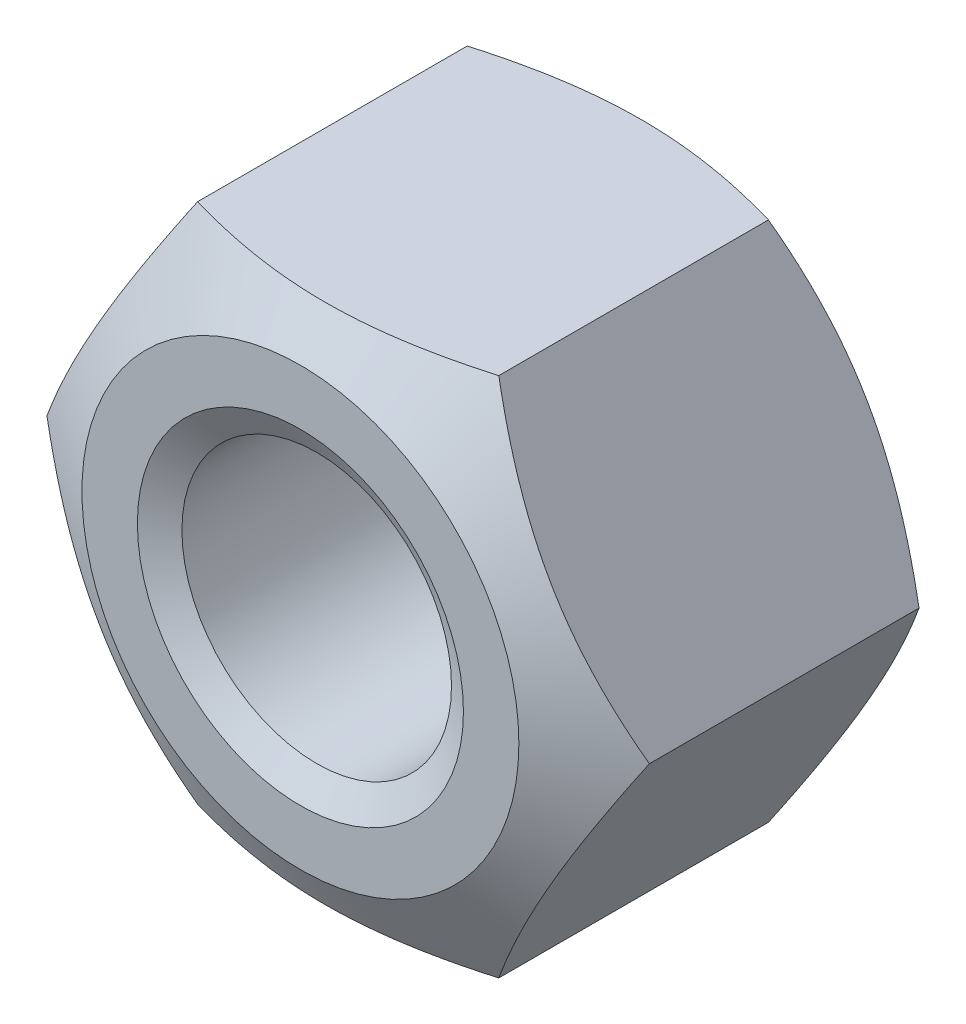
ISO-10303-21;
HEADER;
FILE_DESCRIPTION(('STEP AP214'),'2;1');
FILE_NAME('part.step','',(''),(''),'','','');
FILE_SCHEMA(('AUTOMOTIVE_DESIGN { 1 0 10303 214 1 1 1 1 }'));
ENDSEC;
DATA;
#1=APPLICATION_CONTEXT('core data for automotive mechanical design processes');
#2=APPLICATION_PROTOCOL_DEFINITION('international standard','automotive_design',2000,#1);
#3=PRODUCT_CONTEXT('',#1,'mechanical');
#4=PRODUCT('Part','Part','',(#3));
#5=PRODUCT_RELATED_PRODUCT_CATEGORY('part','',(#4));
#6=PRODUCT_DEFINITION_FORMATION('','',#4);
#7=PRODUCT_DEFINITION_CONTEXT('part definition',#1,'design');
#8=PRODUCT_DEFINITION('design','',#6,#7);
#9=PRODUCT_DEFINITION_SHAPE('','',#8);
#10=(LENGTH_UNIT() NAMED_UNIT(*) SI_UNIT(.MILLI.,.METRE.));
#11=(NAMED_UNIT(*) PLANE_ANGLE_UNIT() SI_UNIT($,.RADIAN.));
#12=(NAMED_UNIT(*) SI_UNIT($,.STERADIAN.) SOLID_ANGLE_UNIT());
#13=UNCERTAINTY_MEASURE_WITH_UNIT(LENGTH_MEASURE(1.E-05),#10,'distance_accuracy_value','');
#14=(GEOMETRIC_REPRESENTATION_CONTEXT(3) GLOBAL_UNCERTAINTY_ASSIGNED_CONTEXT((#13)) GLOBAL_UNIT_ASSIGNED_CONTEXT((#10,
#11,#12)) REPRESENTATION_CONTEXT('',''));
#15=CARTESIAN_POINT('',(0.,0.,0.));
#16=DIRECTION('',(0.,0.,1.));
#17=DIRECTION('',(1.,0.,0.));
#18=AXIS2_PLACEMENT_3D('',#15,#16,#17);
#19=CARTESIAN_POINT('',(0.,0.,0.124996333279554));
#20=DIRECTION('',(0.,0.,-1.));
#21=DIRECTION('',(1.,0.,0.));
#22=AXIS2_PLACEMENT_3D('',#19,#20,#21);
#23=CONICAL_SURFACE('',#22,2.2835,1.0471975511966);
#24=CARTESIAN_POINT('',(0.,0.,0.249992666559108));
#25=DIRECTION('',(0.,0.,1.));
#26=DIRECTION('',(1.,0.,0.));
#27=AXIS2_PLACEMENT_3D('',#24,#25,#26);
#28=CIRCLE('',#27,2.067);
#29=CARTESIAN_POINT('',(2.067,0.,0.249992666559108));
#30=VERTEX_POINT('',#29);
#31=EDGE_CURVE('E11',#30,#30,#28,.T.);
#32=ORIENTED_EDGE('',*,*,#31,.T.);
#33=EDGE_LOOP('',(#32));
#34=FACE_BOUND('',#33,.T.);
#35=CARTESIAN_POINT('',(0.,0.,0.));
#36=DIRECTION('',(0.,0.,1.));
#37=DIRECTION('',(1.,0.,0.));
#38=AXIS2_PLACEMENT_3D('',#35,#36,#37);
#39=CIRCLE('',#38,2.5);
#40=CARTESIAN_POINT('',(2.5,0.,0.));
#41=VERTEX_POINT('',#40);
#42=EDGE_CURVE('E137',#41,#41,#39,.T.);
#43=ORIENTED_EDGE('',*,*,#42,.F.);
#44=EDGE_LOOP('',(#43));
#45=FACE_BOUND('',#44,.T.);
#46=ADVANCED_FACE('F17',(#34,#45),#23,.F.);
#47=CARTESIAN_POINT('',(0.,0.,2.8));
#48=DIRECTION('',(0.,0.,-1.));
#49=DIRECTION('',(1.,0.,0.));
#50=AXIS2_PLACEMENT_3D('',#47,#48,#49);
#51=CYLINDRICAL_SURFACE('',#50,2.067);
#52=CARTESIAN_POINT('',(0.,0.,5.35000733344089));
#53=DIRECTION('',(0.,0.,1.));
#54=DIRECTION('',(1.,0.,0.));
#55=AXIS2_PLACEMENT_3D('',#52,#53,#54);
#56=CIRCLE('',#55,2.067);
#57=CARTESIAN_POINT('',(2.067,0.,5.35000733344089));
#58=VERTEX_POINT('',#57);
#59=EDGE_CURVE('E29',#58,#58,#56,.T.);
#60=ORIENTED_EDGE('',*,*,#59,.T.);
#61=EDGE_LOOP('',(#60));
#62=FACE_BOUND('',#61,.T.);
#63=ORIENTED_EDGE('',*,*,#31,.F.);
#64=EDGE_LOOP('',(#63));
#65=FACE_BOUND('',#64,.T.);
#66=ADVANCED_FACE('F244',(#62,#65),#51,.F.);
#67=CARTESIAN_POINT('',(0.,0.,5.47500366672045));
#68=DIRECTION('',(0.,0.,1.));
#69=DIRECTION('',(1.,0.,0.));
#70=AXIS2_PLACEMENT_3D('',#67,#68,#69);
#71=CONICAL_SURFACE('',#70,2.2835,1.0471975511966);
#72=CARTESIAN_POINT('',(0.,0.,5.6));
#73=DIRECTION('',(0.,0.,-1.));
#74=DIRECTION('',(1.,0.,0.));
#75=AXIS2_PLACEMENT_3D('',#72,#73,#74);
#76=CIRCLE('',#75,2.5);
#77=CARTESIAN_POINT('',(2.5,0.,5.6));
#78=VERTEX_POINT('',#77);
#79=EDGE_CURVE('E98',#78,#78,#76,.T.);
#80=ORIENTED_EDGE('',*,*,#79,.F.);
#81=EDGE_LOOP('',(#80));
#82=FACE_BOUND('',#81,.T.);
#83=ORIENTED_EDGE('',*,*,#59,.F.);
#84=EDGE_LOOP('',(#83));
#85=FACE_BOUND('',#84,.T.);
#86=ADVANCED_FACE('F249',(#82,#85),#71,.F.);
#87=CARTESIAN_POINT('',(0.,0.,0.36627163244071));
#88=DIRECTION('',(0.,0.,1.));
#89=DIRECTION('',(1.,0.,0.));
#90=AXIS2_PLACEMENT_3D('',#87,#88,#89);
#91=CONICAL_SURFACE('',#90,3.98440107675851,1.0471975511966);
#92=CARTESIAN_POINT('',(4.61880215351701,0.,0.73254326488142));
#93=CARTESIAN_POINT('',(3.46410161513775,-2.,0.0658765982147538));
#94=CARTESIAN_POINT('',(2.3094010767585,-4.,0.73254326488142));
#95=(BOUNDED_CURVE() B_SPLINE_CURVE(2,(#92,#93,#94),.UNSPECIFIED.,.F.,
.F.) B_SPLINE_CURVE_WITH_KNOTS((3,3),(0.,4.67374455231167),
.UNSPECIFIED.) CURVE() GEOMETRIC_REPRESENTATION_ITEM() RATIONAL_B_SPLINE_CURVE((1.,
1.15470053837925,1.)) REPRESENTATION_ITEM(''));
#96=CARTESIAN_POINT('',(4.61880215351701,0.,0.73254326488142));
#97=VERTEX_POINT('',#96);
#98=CARTESIAN_POINT('',(2.3094010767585,-4.,0.73254326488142));
#99=VERTEX_POINT('',#98);
#100=EDGE_CURVE('E86',#97,#99,#95,.T.);
#101=ORIENTED_EDGE('',*,*,#100,.T.);
#102=CARTESIAN_POINT('',(2.30940107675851,-4.,0.73254326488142));
#103=CARTESIAN_POINT('',(0.,-4.,0.0658765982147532));
#104=CARTESIAN_POINT('',(-2.30940107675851,-4.,0.73254326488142));
#105=(BOUNDED_CURVE() B_SPLINE_CURVE(2,(#102,#103,#104),.UNSPECIFIED.,.F.,
.F.) B_SPLINE_CURVE_WITH_KNOTS((3,3),(0.,4.67374455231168),
.UNSPECIFIED.) CURVE() GEOMETRIC_REPRESENTATION_ITEM() RATIONAL_B_SPLINE_CURVE((1.,
1.15470053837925,1.)) REPRESENTATION_ITEM(''));
#106=CARTESIAN_POINT('',(-2.30940107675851,-4.,0.73254326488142));
#107=VERTEX_POINT('',#106);
#108=EDGE_CURVE('E79',#99,#107,#105,.T.);
#109=ORIENTED_EDGE('',*,*,#108,.T.);
#110=CARTESIAN_POINT('',(-2.30940107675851,-4.,0.73254326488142));
#111=CARTESIAN_POINT('',(-3.46410161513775,-2.,0.0658765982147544));
#112=CARTESIAN_POINT('',(-4.61880215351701,0.,0.73254326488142));
#113=(BOUNDED_CURVE() B_SPLINE_CURVE(2,(#110,#111,#112),.UNSPECIFIED.,.F.,
.F.) B_SPLINE_CURVE_WITH_KNOTS((3,3),(0.,4.67374455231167),
.UNSPECIFIED.) CURVE() GEOMETRIC_REPRESENTATION_ITEM() RATIONAL_B_SPLINE_CURVE((1.,
1.15470053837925,1.)) REPRESENTATION_ITEM(''));
#114=CARTESIAN_POINT('',(-4.61880215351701,0.,0.73254326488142));
#115=VERTEX_POINT('',#114);
#116=EDGE_CURVE('E70',#107,#115,#113,.T.);
#117=ORIENTED_EDGE('',*,*,#116,.T.);
#118=CARTESIAN_POINT('',(-4.61880215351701,0.,0.73254326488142));
#119=CARTESIAN_POINT('',(-3.46410161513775,2.,0.0658765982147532));
#120=CARTESIAN_POINT('',(-2.3094010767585,4.,0.73254326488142));
#121=(BOUNDED_CURVE() B_SPLINE_CURVE(2,(#118,#119,#120),.UNSPECIFIED.,.F.,
.F.) B_SPLINE_CURVE_WITH_KNOTS((3,3),(0.,4.67374455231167),
.UNSPECIFIED.) CURVE() GEOMETRIC_REPRESENTATION_ITEM() RATIONAL_B_SPLINE_CURVE((1.,
1.15470053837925,1.)) REPRESENTATION_ITEM(''));
#122=CARTESIAN_POINT('',(-2.3094010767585,4.,0.73254326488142));
#123=VERTEX_POINT('',#122);
#124=EDGE_CURVE('E21',#115,#123,#121,.T.);
#125=ORIENTED_EDGE('',*,*,#124,.T.);
#126=CARTESIAN_POINT('',(-2.30940107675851,4.,0.73254326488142));
#127=CARTESIAN_POINT('',(0.,4.,0.0658765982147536));
#128=CARTESIAN_POINT('',(2.30940107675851,4.,0.73254326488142));
#129=(BOUNDED_CURVE() B_SPLINE_CURVE(2,(#126,#127,#128),.UNSPECIFIED.,.F.,
.F.) B_SPLINE_CURVE_WITH_KNOTS((3,3),(0.,4.67374455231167),
.UNSPECIFIED.) CURVE() GEOMETRIC_REPRESENTATION_ITEM() RATIONAL_B_SPLINE_CURVE((1.,
1.15470053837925,1.)) REPRESENTATION_ITEM(''));
#130=CARTESIAN_POINT('',(2.30940107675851,4.,0.73254326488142));
#131=VERTEX_POINT('',#130);
#132=EDGE_CURVE('E177',#123,#131,#129,.T.);
#133=ORIENTED_EDGE('',*,*,#132,.T.);
#134=CARTESIAN_POINT('',(2.30940107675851,4.,0.73254326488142));
#135=CARTESIAN_POINT('',(3.46410161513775,2.,0.065876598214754));
#136=CARTESIAN_POINT('',(4.61880215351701,0.,0.73254326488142));
#137=(BOUNDED_CURVE() B_SPLINE_CURVE(2,(#134,#135,#136),.UNSPECIFIED.,.F.,
.F.) B_SPLINE_CURVE_WITH_KNOTS((3,3),(0.,4.67374455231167),
.UNSPECIFIED.) CURVE() GEOMETRIC_REPRESENTATION_ITEM() RATIONAL_B_SPLINE_CURVE((1.,
1.15470053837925,1.)) REPRESENTATION_ITEM(''));
#138=EDGE_CURVE('E119',#131,#97,#137,.T.);
#139=ORIENTED_EDGE('',*,*,#138,.T.);
#140=EDGE_LOOP('',(#101,#109,#117,#125,#133,#139));
#141=FACE_BOUND('',#140,.T.);
#142=CARTESIAN_POINT('',(0.,0.,0.));
#143=DIRECTION('',(0.,0.,1.));
#144=DIRECTION('',(1.,0.,0.));
#145=AXIS2_PLACEMENT_3D('',#142,#143,#144);
#146=CIRCLE('',#145,3.35);
#147=CARTESIAN_POINT('',(3.35,0.,0.));
#148=VERTEX_POINT('',#147);
#149=EDGE_CURVE('E113',#148,#148,#146,.T.);
#150=ORIENTED_EDGE('',*,*,#149,.T.);
#151=EDGE_LOOP('',(#150));
#152=FACE_BOUND('',#151,.T.);
#153=ADVANCED_FACE('F82',(#141,#152),#91,.T.);
#154=CARTESIAN_POINT('',(0.,0.,5.23372836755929));
#155=DIRECTION('',(0.,0.,-1.));
#156=DIRECTION('',(1.,0.,0.));
#157=AXIS2_PLACEMENT_3D('',#154,#155,#156);
#158=CONICAL_SURFACE('',#157,3.98440107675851,1.0471975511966);
#159=CARTESIAN_POINT('',(2.3094010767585,-4.,4.86745673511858));
#160=CARTESIAN_POINT('',(3.46410161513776,-2.,5.53412340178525));
#161=CARTESIAN_POINT('',(4.61880215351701,0.,4.86745673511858));
#162=(BOUNDED_CURVE() B_SPLINE_CURVE(2,(#159,#160,#161),.UNSPECIFIED.,.F.,
.F.) B_SPLINE_CURVE_WITH_KNOTS((3,3),(0.,4.67374455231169),
.UNSPECIFIED.) CURVE() GEOMETRIC_REPRESENTATION_ITEM() RATIONAL_B_SPLINE_CURVE((1.,
1.15470053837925,1.)) REPRESENTATION_ITEM(''));
#163=CARTESIAN_POINT('',(2.3094010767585,-4.,4.86745673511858));
#164=VERTEX_POINT('',#163);
#165=CARTESIAN_POINT('',(4.61880215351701,0.,4.86745673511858));
#166=VERTEX_POINT('',#165);
#167=EDGE_CURVE('E120',#164,#166,#162,.T.);
#168=ORIENTED_EDGE('',*,*,#167,.T.);
#169=CARTESIAN_POINT('',(4.61880215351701,0.,4.86745673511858));
#170=CARTESIAN_POINT('',(3.46410161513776,2.,5.53412340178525));
#171=CARTESIAN_POINT('',(2.3094010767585,4.,4.86745673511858));
#172=(BOUNDED_CURVE() B_SPLINE_CURVE(2,(#169,#170,#171),.UNSPECIFIED.,.F.,
.F.) B_SPLINE_CURVE_WITH_KNOTS((3,3),(0.,4.67374455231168),
.UNSPECIFIED.) CURVE() GEOMETRIC_REPRESENTATION_ITEM() RATIONAL_B_SPLINE_CURVE((1.,
1.15470053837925,1.)) REPRESENTATION_ITEM(''));
#173=CARTESIAN_POINT('',(2.30940107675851,4.,4.86745673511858));
#174=VERTEX_POINT('',#173);
#175=EDGE_CURVE('E111',#166,#174,#172,.T.);
#176=ORIENTED_EDGE('',*,*,#175,.T.);
#177=CARTESIAN_POINT('',(2.30940107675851,4.,4.86745673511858));
#178=CARTESIAN_POINT('',(0.,4.,5.53412340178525));
#179=CARTESIAN_POINT('',(-2.30940107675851,4.,4.86745673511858));
#180=(BOUNDED_CURVE() B_SPLINE_CURVE(2,(#177,#178,#179),.UNSPECIFIED.,.F.,
.F.) B_SPLINE_CURVE_WITH_KNOTS((3,3),(0.,4.67374455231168),
.UNSPECIFIED.) CURVE() GEOMETRIC_REPRESENTATION_ITEM() RATIONAL_B_SPLINE_CURVE((1.,
1.15470053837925,1.)) REPRESENTATION_ITEM(''));
#181=CARTESIAN_POINT('',(-2.3094010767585,4.,4.86745673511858));
#182=VERTEX_POINT('',#181);
#183=EDGE_CURVE('E103',#174,#182,#180,.T.);
#184=ORIENTED_EDGE('',*,*,#183,.T.);
#185=CARTESIAN_POINT('',(-2.3094010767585,4.,4.86745673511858));
#186=CARTESIAN_POINT('',(-3.46410161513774,2.,5.53412340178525));
#187=CARTESIAN_POINT('',(-4.61880215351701,0.,4.86745673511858));
#188=(BOUNDED_CURVE() B_SPLINE_CURVE(2,(#185,#186,#187),.UNSPECIFIED.,.F.,
.F.) B_SPLINE_CURVE_WITH_KNOTS((3,3),(0.,4.67374455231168),
.UNSPECIFIED.) CURVE() GEOMETRIC_REPRESENTATION_ITEM() RATIONAL_B_SPLINE_CURVE((1.,
1.15470053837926,1.)) REPRESENTATION_ITEM(''));
#189=CARTESIAN_POINT('',(-4.61880215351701,0.,4.86745673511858));
#190=VERTEX_POINT('',#189);
#191=EDGE_CURVE('E112',#182,#190,#188,.T.);
#192=ORIENTED_EDGE('',*,*,#191,.T.);
#193=CARTESIAN_POINT('',(-4.61880215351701,0.,4.86745673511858));
#194=CARTESIAN_POINT('',(-3.46410161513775,-2.,5.53412340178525));
#195=CARTESIAN_POINT('',(-2.30940107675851,-4.,4.86745673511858));
#196=(BOUNDED_CURVE() B_SPLINE_CURVE(2,(#193,#194,#195),.UNSPECIFIED.,.F.,
.F.) B_SPLINE_CURVE_WITH_KNOTS((3,3),(0.,4.67374455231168),
.UNSPECIFIED.) CURVE() GEOMETRIC_REPRESENTATION_ITEM() RATIONAL_B_SPLINE_CURVE((1.,
1.15470053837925,1.)) REPRESENTATION_ITEM(''));
#197=CARTESIAN_POINT('',(-2.30940107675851,-4.,4.86745673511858));
#198=VERTEX_POINT('',#197);
#199=EDGE_CURVE('E151',#190,#198,#196,.T.);
#200=ORIENTED_EDGE('',*,*,#199,.T.);
#201=CARTESIAN_POINT('',(-2.30940107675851,-4.,4.86745673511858));
#202=CARTESIAN_POINT('',(0.,-4.00000000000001,5.53412340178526));
#203=CARTESIAN_POINT('',(2.30940107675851,-4.,4.86745673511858));
#204=(BOUNDED_CURVE() B_SPLINE_CURVE(2,(#201,#202,#203),.UNSPECIFIED.,.F.,
.F.) B_SPLINE_CURVE_WITH_KNOTS((3,3),(0.,4.67374455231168),
.UNSPECIFIED.) CURVE() GEOMETRIC_REPRESENTATION_ITEM() RATIONAL_B_SPLINE_CURVE((1.,
1.15470053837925,1.)) REPRESENTATION_ITEM(''));
#205=EDGE_CURVE('E94',#198,#164,#204,.T.);
#206=ORIENTED_EDGE('',*,*,#205,.T.);
#207=EDGE_LOOP('',(#168,#176,#184,#192,#200,#206));
#208=FACE_BOUND('',#207,.T.);
#209=CARTESIAN_POINT('',(0.,0.,5.6));
#210=DIRECTION('',(0.,0.,-1.));
#211=DIRECTION('',(1.,0.,0.));
#212=AXIS2_PLACEMENT_3D('',#209,#210,#211);
#213=CIRCLE('',#212,3.35);
#214=CARTESIAN_POINT('',(3.35,0.,5.6));
#215=VERTEX_POINT('',#214);
#216=EDGE_CURVE('E121',#215,#215,#213,.T.);
#217=ORIENTED_EDGE('',*,*,#216,.T.);
#218=EDGE_LOOP('',(#217));
#219=FACE_BOUND('',#218,.T.);
#220=ADVANCED_FACE('F213',(#208,#219),#158,.T.);
#221=CARTESIAN_POINT('',(-3.46410161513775,2.,0.));
#222=DIRECTION('',(-0.866025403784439,0.5,0.));
#223=DIRECTION('',(-0.5,-0.866025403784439,0.));
#224=AXIS2_PLACEMENT_3D('',#221,#222,#223);
#225=PLANE('',#224);
#226=ORIENTED_EDGE('',*,*,#191,.F.);
#227=DIRECTION('',(0.,0.,1.));
#228=VECTOR('',#227,1.);
#229=CARTESIAN_POINT('',(-2.3094010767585,4.,0.));
#230=LINE('',#229,#228);
#231=EDGE_CURVE('E124',#123,#182,#230,.T.);
#232=ORIENTED_EDGE('',*,*,#231,.F.);
#233=ORIENTED_EDGE('',*,*,#124,.F.);
#234=DIRECTION('',(0.,0.,1.));
#235=VECTOR('',#234,1.);
#236=CARTESIAN_POINT('',(-4.61880215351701,0.,0.));
#237=LINE('',#236,#235);
#238=EDGE_CURVE('E76',#115,#190,#237,.T.);
#239=ORIENTED_EDGE('',*,*,#238,.T.);
#240=EDGE_LOOP('',(#226,#232,#233,#239));
#241=FACE_BOUND('',#240,.T.);
#242=ADVANCED_FACE('F192',(#241),#225,.T.);
#243=CARTESIAN_POINT('',(0.,4.,0.));
#244=DIRECTION('',(0.,1.,0.));
#245=DIRECTION('',(-1.,0.,0.));
#246=AXIS2_PLACEMENT_3D('',#243,#244,#245);
#247=PLANE('',#246);
#248=ORIENTED_EDGE('',*,*,#183,.F.);
#249=DIRECTION('',(0.,0.,1.));
#250=VECTOR('',#249,1.);
#251=CARTESIAN_POINT('',(2.30940107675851,4.,0.));
#252=LINE('',#251,#250);
#253=EDGE_CURVE('E127',#131,#174,#252,.T.);
#254=ORIENTED_EDGE('',*,*,#253,.F.);
#255=ORIENTED_EDGE('',*,*,#132,.F.);
#256=ORIENTED_EDGE('',*,*,#231,.T.);
#257=EDGE_LOOP('',(#248,#254,#255,#256));
#258=FACE_BOUND('',#257,.T.);
#259=ADVANCED_FACE('F195',(#258),#247,.T.);
#260=CARTESIAN_POINT('',(3.46410161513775,2.,0.));
#261=DIRECTION('',(0.866025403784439,0.5,0.));
#262=DIRECTION('',(-0.5,0.866025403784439,0.));
#263=AXIS2_PLACEMENT_3D('',#260,#261,#262);
#264=PLANE('',#263);
#265=ORIENTED_EDGE('',*,*,#175,.F.);
#266=DIRECTION('',(0.,0.,1.));
#267=VECTOR('',#266,1.);
#268=CARTESIAN_POINT('',(4.61880215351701,0.,0.));
#269=LINE('',#268,#267);
#270=EDGE_CURVE('E159',#97,#166,#269,.T.);
#271=ORIENTED_EDGE('',*,*,#270,.F.);
#272=ORIENTED_EDGE('',*,*,#138,.F.);
#273=ORIENTED_EDGE('',*,*,#253,.T.);
#274=EDGE_LOOP('',(#265,#271,#272,#273));
#275=FACE_BOUND('',#274,.T.);
#276=ADVANCED_FACE('F198',(#275),#264,.T.);
#277=CARTESIAN_POINT('',(3.46410161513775,-2.,0.));
#278=DIRECTION('',(0.866025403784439,-0.5,0.));
#279=DIRECTION('',(0.5,0.866025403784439,0.));
#280=AXIS2_PLACEMENT_3D('',#277,#278,#279);
#281=PLANE('',#280);
#282=ORIENTED_EDGE('',*,*,#167,.F.);
#283=DIRECTION('',(0.,0.,1.));
#284=VECTOR('',#283,1.);
#285=CARTESIAN_POINT('',(2.30940107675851,-4.,0.));
#286=LINE('',#285,#284);
#287=EDGE_CURVE('E96',#99,#164,#286,.T.);
#288=ORIENTED_EDGE('',*,*,#287,.F.);
#289=ORIENTED_EDGE('',*,*,#100,.F.);
#290=ORIENTED_EDGE('',*,*,#270,.T.);
#291=EDGE_LOOP('',(#282,#288,#289,#290));
#292=FACE_BOUND('',#291,.T.);
#293=ADVANCED_FACE('F19',(#292),#281,.T.);
#294=CARTESIAN_POINT('',(0.,0.,0.));
#295=DIRECTION('',(0.,0.,1.));
#296=DIRECTION('',(0.,-1.,0.));
#297=AXIS2_PLACEMENT_3D('',#294,#295,#296);
#298=PLANE('',#297);
#299=ORIENTED_EDGE('',*,*,#42,.T.);
#300=EDGE_LOOP('',(#299));
#301=FACE_BOUND('',#300,.T.);
#302=ORIENTED_EDGE('',*,*,#149,.F.);
#303=EDGE_LOOP('',(#302));
#304=FACE_BOUND('',#303,.T.);
#305=ADVANCED_FACE('F231',(#301,#304),#298,.F.);
#306=CARTESIAN_POINT('',(0.,0.,5.6));
#307=DIRECTION('',(0.,0.,1.));
#308=DIRECTION('',(0.,-1.,0.));
#309=AXIS2_PLACEMENT_3D('',#306,#307,#308);
#310=PLANE('',#309);
#311=ORIENTED_EDGE('',*,*,#79,.T.);
#312=EDGE_LOOP('',(#311));
#313=FACE_BOUND('',#312,.T.);
#314=ORIENTED_EDGE('',*,*,#216,.F.);
#315=EDGE_LOOP('',(#314));
#316=FACE_BOUND('',#315,.T.);
#317=ADVANCED_FACE('F229',(#313,#316),#310,.T.);
#318=CARTESIAN_POINT('',(0.,-4.,0.));
#319=DIRECTION('',(0.,-1.,0.));
#320=DIRECTION('',(1.,0.,0.));
#321=AXIS2_PLACEMENT_3D('',#318,#319,#320);
#322=PLANE('',#321);
#323=ORIENTED_EDGE('',*,*,#205,.F.);
#324=DIRECTION('',(0.,0.,1.));
#325=VECTOR('',#324,1.);
#326=CARTESIAN_POINT('',(-2.30940107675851,-4.,0.));
#327=LINE('',#326,#325);
#328=EDGE_CURVE('E74',#107,#198,#327,.T.);
#329=ORIENTED_EDGE('',*,*,#328,.F.);
#330=ORIENTED_EDGE('',*,*,#108,.F.);
#331=ORIENTED_EDGE('',*,*,#287,.T.);
#332=EDGE_LOOP('',(#323,#329,#330,#331));
#333=FACE_BOUND('',#332,.T.);
#334=ADVANCED_FACE('F92',(#333),#322,.T.);
#335=CARTESIAN_POINT('',(-3.46410161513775,-2.,0.));
#336=DIRECTION('',(-0.866025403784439,-0.5,0.));
#337=DIRECTION('',(0.5,-0.866025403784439,0.));
#338=AXIS2_PLACEMENT_3D('',#335,#336,#337);
#339=PLANE('',#338);
#340=ORIENTED_EDGE('',*,*,#199,.F.);
#341=ORIENTED_EDGE('',*,*,#238,.F.);
#342=ORIENTED_EDGE('',*,*,#116,.F.);
#343=ORIENTED_EDGE('',*,*,#328,.T.);
#344=EDGE_LOOP('',(#340,#341,#342,#343));
#345=FACE_BOUND('',#344,.T.);
#346=ADVANCED_FACE('F72',(#345),#339,.T.);
#347=CLOSED_SHELL('',(#46,#66,#86,#153,#220,#242,#259,#276,#293,#305,#317,#334,#346));
#348=MANIFOLD_SOLID_BREP('B1',#347);
#349=ADVANCED_BREP_SHAPE_REPRESENTATION('',(#18,#348),#14);
#350=SHAPE_DEFINITION_REPRESENTATION(#9,#349);
ENDSEC;
END-ISO-10303-21;
